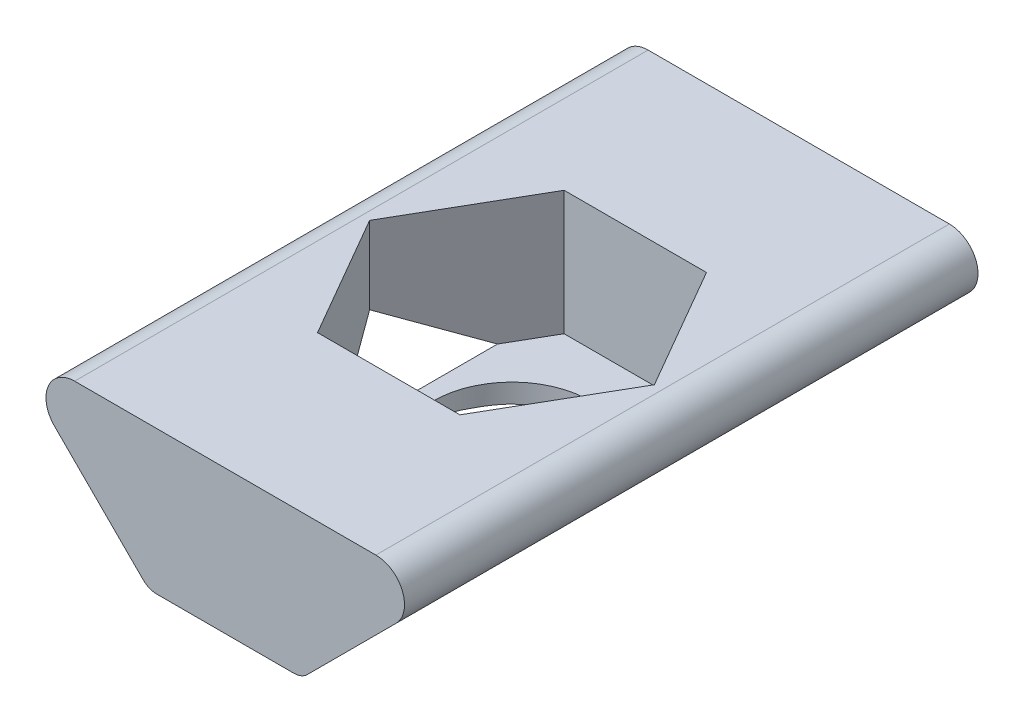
ISO-10303-21;
HEADER;
FILE_DESCRIPTION(('STEP AP214'),'2;1');
FILE_NAME('part.step','',(''),(''),'','','');
FILE_SCHEMA(('AUTOMOTIVE_DESIGN { 1 0 10303 214 1 1 1 1 }'));
ENDSEC;
DATA;
#1=APPLICATION_CONTEXT('core data for automotive mechanical design processes');
#2=APPLICATION_PROTOCOL_DEFINITION('international standard','automotive_design',2000,#1);
#3=PRODUCT_CONTEXT('',#1,'mechanical');
#4=PRODUCT('Part','Part','',(#3));
#5=PRODUCT_RELATED_PRODUCT_CATEGORY('part','',(#4));
#6=PRODUCT_DEFINITION_FORMATION('','',#4);
#7=PRODUCT_DEFINITION_CONTEXT('part definition',#1,'design');
#8=PRODUCT_DEFINITION('design','',#6,#7);
#9=PRODUCT_DEFINITION_SHAPE('','',#8);
#10=(LENGTH_UNIT() NAMED_UNIT(*) SI_UNIT(.MILLI.,.METRE.));
#11=(NAMED_UNIT(*) PLANE_ANGLE_UNIT() SI_UNIT($,.RADIAN.));
#12=(NAMED_UNIT(*) SI_UNIT($,.STERADIAN.) SOLID_ANGLE_UNIT());
#13=UNCERTAINTY_MEASURE_WITH_UNIT(LENGTH_MEASURE(1.E-05),#10,'distance_accuracy_value','');
#14=(GEOMETRIC_REPRESENTATION_CONTEXT(3) GLOBAL_UNCERTAINTY_ASSIGNED_CONTEXT((#13)) GLOBAL_UNIT_ASSIGNED_CONTEXT((#10,
#11,#12)) REPRESENTATION_CONTEXT('',''));
#15=CARTESIAN_POINT('',(0.,0.,0.));
#16=DIRECTION('',(0.,0.,1.));
#17=DIRECTION('',(1.,0.,0.));
#18=AXIS2_PLACEMENT_3D('',#15,#16,#17);
#19=CARTESIAN_POINT('',(-4.,-3.75,15.));
#20=DIRECTION('',(0.,1.,0.));
#21=DIRECTION('',(0.,0.,1.));
#22=AXIS2_PLACEMENT_3D('',#19,#20,#21);
#23=PLANE('',#22);
#24=DIRECTION('',(0.,0.,-1.));
#25=VECTOR('',#24,1.);
#26=CARTESIAN_POINT('',(3.58578643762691,-3.75,15.));
#27=LINE('',#26,#25);
#28=CARTESIAN_POINT('',(3.58578643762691,-3.75,-15.));
#29=VERTEX_POINT('',#28);
#30=CARTESIAN_POINT('',(3.58578643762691,-3.75,-1.98799789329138));
#31=VERTEX_POINT('',#30);
#32=EDGE_CURVE('E194',#29,#31,#27,.F.);
#33=ORIENTED_EDGE('',*,*,#32,.T.);
#34=CARTESIAN_POINT('',(0.,-3.75,0.));
#35=DIRECTION('',(0.,1.,0.));
#36=DIRECTION('',(0.,0.,1.));
#37=AXIS2_PLACEMENT_3D('',#34,#35,#36);
#38=CIRCLE('',#37,4.1);
#39=CARTESIAN_POINT('',(-3.58578643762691,-3.75,-1.98799789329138));
#40=VERTEX_POINT('',#39);
#41=EDGE_CURVE('E169',#31,#40,#38,.T.);
#42=ORIENTED_EDGE('',*,*,#41,.T.);
#43=DIRECTION('',(0.,0.,-1.));
#44=VECTOR('',#43,1.);
#45=CARTESIAN_POINT('',(-3.58578643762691,-3.75,15.));
#46=LINE('',#45,#44);
#47=CARTESIAN_POINT('',(-3.58578643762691,-3.75,-15.));
#48=VERTEX_POINT('',#47);
#49=EDGE_CURVE('E193',#40,#48,#46,.T.);
#50=ORIENTED_EDGE('',*,*,#49,.T.);
#51=DIRECTION('',(1.,0.,0.));
#52=VECTOR('',#51,1.);
#53=CARTESIAN_POINT('',(-4.,-3.75,-15.));
#54=LINE('',#53,#52);
#55=EDGE_CURVE('E247',#48,#29,#54,.T.);
#56=ORIENTED_EDGE('',*,*,#55,.T.);
#57=EDGE_LOOP('',(#33,#42,#50,#56));
#58=FACE_BOUND('',#57,.T.);
#59=ADVANCED_FACE('F37',(#58),#23,.F.);
#60=CARTESIAN_POINT('',(11.5,3.75000000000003,15.));
#61=DIRECTION('',(-0.707106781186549,0.707106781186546,0.));
#62=DIRECTION('',(-0.707106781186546,-0.707106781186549,0.));
#63=AXIS2_PLACEMENT_3D('',#60,#61,#62);
#64=PLANE('',#63);
#65=DIRECTION('',(0.,0.,-1.));
#66=VECTOR('',#65,1.);
#67=CARTESIAN_POINT('',(5.00000000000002,-2.74999999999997,15.));
#68=LINE('',#67,#66);
#69=CARTESIAN_POINT('',(5.00000000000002,-2.74999999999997,4.23974596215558));
#70=VERTEX_POINT('',#69);
#71=CARTESIAN_POINT('',(5.00000000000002,-2.74999999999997,-4.23974596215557));
#72=VERTEX_POINT('',#71);
#73=EDGE_CURVE('E236',#70,#72,#68,.T.);
#74=ORIENTED_EDGE('',*,*,#73,.F.);
#75=DIRECTION('',(0.447213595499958,0.447213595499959,-0.774596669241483));
#76=VECTOR('',#75,1.);
#77=CARTESIAN_POINT('',(3.87253866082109,-3.87746133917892,6.19256628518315));
#78=LINE('',#77,#76);
#79=CARTESIAN_POINT('',(7.44781847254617,-0.302181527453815,0.));
#80=VERTEX_POINT('',#79);
#81=EDGE_CURVE('E241',#70,#80,#78,.T.);
#82=ORIENTED_EDGE('',*,*,#81,.T.);
#83=DIRECTION('',(-0.447213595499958,-0.447213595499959,-0.774596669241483));
#84=VECTOR('',#83,1.);
#85=CARTESIAN_POINT('',(14.2648435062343,6.51484350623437,11.8074337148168));
#86=LINE('',#85,#84);
#87=EDGE_CURVE('E238',#80,#72,#86,.T.);
#88=ORIENTED_EDGE('',*,*,#87,.T.);
#89=EDGE_LOOP('',(#74,#82,#88));
#90=FACE_BOUND('',#89,.T.);
#91=DIRECTION('',(0.707106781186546,0.707106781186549,0.));
#92=VECTOR('',#91,1.);
#93=CARTESIAN_POINT('',(11.5,3.75000000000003,15.));
#94=LINE('',#93,#92);
#95=CARTESIAN_POINT('',(4.29289321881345,-3.45710678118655,15.));
#96=VERTEX_POINT('',#95);
#97=CARTESIAN_POINT('',(8.93933982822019,1.18933982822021,15.));
#98=VERTEX_POINT('',#97);
#99=EDGE_CURVE('E244',#96,#98,#94,.T.);
#100=ORIENTED_EDGE('',*,*,#99,.F.);
#101=DIRECTION('',(0.,0.,-1.));
#102=VECTOR('',#101,1.);
#103=CARTESIAN_POINT('',(4.29289321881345,-3.45710678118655,15.));
#104=LINE('',#103,#102);
#105=CARTESIAN_POINT('',(4.29289321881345,-3.45710678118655,-15.));
#106=VERTEX_POINT('',#105);
#107=EDGE_CURVE('E283',#96,#106,#104,.T.);
#108=ORIENTED_EDGE('',*,*,#107,.T.);
#109=DIRECTION('',(0.707106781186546,0.707106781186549,0.));
#110=VECTOR('',#109,1.);
#111=CARTESIAN_POINT('',(11.5,3.75000000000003,-15.));
#112=LINE('',#111,#110);
#113=CARTESIAN_POINT('',(8.93933982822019,1.18933982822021,-15.));
#114=VERTEX_POINT('',#113);
#115=EDGE_CURVE('E242',#106,#114,#112,.T.);
#116=ORIENTED_EDGE('',*,*,#115,.T.);
#117=DIRECTION('',(0.,0.,-1.));
#118=VECTOR('',#117,1.);
#119=CARTESIAN_POINT('',(8.93933982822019,1.18933982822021,15.));
#120=LINE('',#119,#118);
#121=EDGE_CURVE('E273',#114,#98,#120,.F.);
#122=ORIENTED_EDGE('',*,*,#121,.T.);
#123=EDGE_LOOP('',(#100,#108,#116,#122));
#124=FACE_BOUND('',#123,.T.);
#125=ADVANCED_FACE('F320',(#90,#124),#64,.F.);
#126=CARTESIAN_POINT('',(11.5,3.75000000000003,15.));
#127=DIRECTION('',(0.,-1.,0.));
#128=DIRECTION('',(0.,0.,-1.));
#129=AXIS2_PLACEMENT_3D('',#126,#127,#128);
#130=PLANE('',#129);
#131=DIRECTION('',(-0.5,0.,-0.866025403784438));
#132=VECTOR('',#131,1.);
#133=CARTESIAN_POINT('',(7.44781847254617,3.75000000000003,0.));
#134=LINE('',#133,#132);
#135=CARTESIAN_POINT('',(7.44781847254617,3.75000000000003,0.));
#136=VERTEX_POINT('',#135);
#137=CARTESIAN_POINT('',(3.72390923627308,3.75000000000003,-6.45));
#138=VERTEX_POINT('',#137);
#139=EDGE_CURVE('E398',#136,#138,#134,.T.);
#140=ORIENTED_EDGE('',*,*,#139,.F.);
#141=DIRECTION('',(0.5,0.,-0.866025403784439));
#142=VECTOR('',#141,1.);
#143=CARTESIAN_POINT('',(3.72390923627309,3.75000000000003,6.45));
#144=LINE('',#143,#142);
#145=CARTESIAN_POINT('',(3.72390923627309,3.75000000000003,6.45));
#146=VERTEX_POINT('',#145);
#147=EDGE_CURVE('E172',#146,#136,#144,.T.);
#148=ORIENTED_EDGE('',*,*,#147,.F.);
#149=DIRECTION('',(1.,0.,0.));
#150=VECTOR('',#149,1.);
#151=CARTESIAN_POINT('',(-3.72390923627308,3.75000000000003,6.45));
#152=LINE('',#151,#150);
#153=CARTESIAN_POINT('',(-3.72390923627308,3.75000000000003,6.45));
#154=VERTEX_POINT('',#153);
#155=EDGE_CURVE('E389',#154,#146,#152,.T.);
#156=ORIENTED_EDGE('',*,*,#155,.F.);
#157=DIRECTION('',(0.5,0.,0.866025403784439));
#158=VECTOR('',#157,1.);
#159=CARTESIAN_POINT('',(-7.44781847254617,3.75000000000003,0.));
#160=LINE('',#159,#158);
#161=CARTESIAN_POINT('',(-7.44781847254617,3.75000000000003,0.));
#162=VERTEX_POINT('',#161);
#163=EDGE_CURVE('E401',#162,#154,#160,.T.);
#164=ORIENTED_EDGE('',*,*,#163,.F.);
#165=DIRECTION('',(-0.5,0.,0.866025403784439));
#166=VECTOR('',#165,1.);
#167=CARTESIAN_POINT('',(-3.72390923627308,3.75000000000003,-6.45));
#168=LINE('',#167,#166);
#169=CARTESIAN_POINT('',(-3.72390923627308,3.75000000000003,-6.45));
#170=VERTEX_POINT('',#169);
#171=EDGE_CURVE('E219',#170,#162,#168,.T.);
#172=ORIENTED_EDGE('',*,*,#171,.F.);
#173=DIRECTION('',(-1.,0.,0.));
#174=VECTOR('',#173,1.);
#175=CARTESIAN_POINT('',(3.72390923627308,3.75000000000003,-6.45));
#176=LINE('',#175,#174);
#177=EDGE_CURVE('E400',#138,#170,#176,.T.);
#178=ORIENTED_EDGE('',*,*,#177,.F.);
#179=EDGE_LOOP('',(#140,#148,#156,#164,#172,#178));
#180=FACE_BOUND('',#179,.T.);
#181=DIRECTION('',(-1.,0.,0.));
#182=VECTOR('',#181,1.);
#183=CARTESIAN_POINT('',(11.5,3.75000000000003,15.));
#184=LINE('',#183,#182);
#185=CARTESIAN_POINT('',(7.87867965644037,3.75000000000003,15.));
#186=VERTEX_POINT('',#185);
#187=CARTESIAN_POINT('',(-7.87867965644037,3.75000000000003,15.));
#188=VERTEX_POINT('',#187);
#189=EDGE_CURVE('E250',#186,#188,#184,.T.);
#190=ORIENTED_EDGE('',*,*,#189,.F.);
#191=DIRECTION('',(0.,0.,-1.));
#192=VECTOR('',#191,1.);
#193=CARTESIAN_POINT('',(7.87867965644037,3.75000000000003,15.));
#194=LINE('',#193,#192);
#195=CARTESIAN_POINT('',(7.87867965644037,3.75000000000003,-15.));
#196=VERTEX_POINT('',#195);
#197=EDGE_CURVE('E269',#186,#196,#194,.T.);
#198=ORIENTED_EDGE('',*,*,#197,.T.);
#199=DIRECTION('',(-1.,0.,0.));
#200=VECTOR('',#199,1.);
#201=CARTESIAN_POINT('',(11.5,3.75000000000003,-15.));
#202=LINE('',#201,#200);
#203=CARTESIAN_POINT('',(-7.87867965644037,3.75000000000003,-15.));
#204=VERTEX_POINT('',#203);
#205=EDGE_CURVE('E260',#196,#204,#202,.T.);
#206=ORIENTED_EDGE('',*,*,#205,.T.);
#207=DIRECTION('',(0.,0.,-1.));
#208=VECTOR('',#207,1.);
#209=CARTESIAN_POINT('',(-7.87867965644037,3.75000000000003,15.));
#210=LINE('',#209,#208);
#211=EDGE_CURVE('E259',#204,#188,#210,.F.);
#212=ORIENTED_EDGE('',*,*,#211,.T.);
#213=EDGE_LOOP('',(#190,#198,#206,#212));
#214=FACE_BOUND('',#213,.T.);
#215=ADVANCED_FACE('F321',(#180,#214),#130,.F.);
#216=CARTESIAN_POINT('',(-11.5,3.75000000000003,15.));
#217=DIRECTION('',(0.707106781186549,0.707106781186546,0.));
#218=DIRECTION('',(-0.707106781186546,0.707106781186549,0.));
#219=AXIS2_PLACEMENT_3D('',#216,#217,#218);
#220=PLANE('',#219);
#221=DIRECTION('',(-0.447213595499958,0.447213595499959,0.774596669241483));
#222=VECTOR('',#221,1.);
#223=CARTESIAN_POINT('',(-14.2648435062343,6.51484350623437,11.8074337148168));
#224=LINE('',#223,#222);
#225=CARTESIAN_POINT('',(-5.00000000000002,-2.74999999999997,-4.23974596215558));
#226=VERTEX_POINT('',#225);
#227=CARTESIAN_POINT('',(-7.44781847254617,-0.302181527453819,0.));
#228=VERTEX_POINT('',#227);
#229=EDGE_CURVE('E47',#226,#228,#224,.T.);
#230=ORIENTED_EDGE('',*,*,#229,.T.);
#231=DIRECTION('',(0.447213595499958,-0.447213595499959,0.774596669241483));
#232=VECTOR('',#231,1.);
#233=CARTESIAN_POINT('',(-3.87253866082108,-3.87746133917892,6.19256628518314));
#234=LINE('',#233,#232);
#235=CARTESIAN_POINT('',(-5.00000000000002,-2.74999999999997,4.23974596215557));
#236=VERTEX_POINT('',#235);
#237=EDGE_CURVE('E11',#228,#236,#234,.T.);
#238=ORIENTED_EDGE('',*,*,#237,.T.);
#239=DIRECTION('',(0.,0.,1.));
#240=VECTOR('',#239,1.);
#241=CARTESIAN_POINT('',(-5.00000000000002,-2.74999999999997,15.));
#242=LINE('',#241,#240);
#243=EDGE_CURVE('E204',#226,#236,#242,.T.);
#244=ORIENTED_EDGE('',*,*,#243,.F.);
#245=EDGE_LOOP('',(#230,#238,#244));
#246=FACE_BOUND('',#245,.T.);
#247=DIRECTION('',(0.707106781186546,-0.707106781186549,0.));
#248=VECTOR('',#247,1.);
#249=CARTESIAN_POINT('',(-11.5,3.75000000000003,-15.));
#250=LINE('',#249,#248);
#251=CARTESIAN_POINT('',(-8.93933982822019,1.18933982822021,-15.));
#252=VERTEX_POINT('',#251);
#253=CARTESIAN_POINT('',(-4.29289321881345,-3.45710678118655,-15.));
#254=VERTEX_POINT('',#253);
#255=EDGE_CURVE('E262',#252,#254,#250,.T.);
#256=ORIENTED_EDGE('',*,*,#255,.T.);
#257=DIRECTION('',(0.,0.,-1.));
#258=VECTOR('',#257,1.);
#259=CARTESIAN_POINT('',(-4.29289321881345,-3.45710678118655,15.));
#260=LINE('',#259,#258);
#261=CARTESIAN_POINT('',(-4.29289321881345,-3.45710678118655,15.));
#262=VERTEX_POINT('',#261);
#263=EDGE_CURVE('E198',#254,#262,#260,.F.);
#264=ORIENTED_EDGE('',*,*,#263,.T.);
#265=DIRECTION('',(0.707106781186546,-0.707106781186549,0.));
#266=VECTOR('',#265,1.);
#267=CARTESIAN_POINT('',(-11.5,3.75000000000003,15.));
#268=LINE('',#267,#266);
#269=CARTESIAN_POINT('',(-8.93933982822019,1.18933982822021,15.));
#270=VERTEX_POINT('',#269);
#271=EDGE_CURVE('E252',#270,#262,#268,.T.);
#272=ORIENTED_EDGE('',*,*,#271,.F.);
#273=DIRECTION('',(0.,0.,-1.));
#274=VECTOR('',#273,1.);
#275=CARTESIAN_POINT('',(-8.93933982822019,1.18933982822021,15.));
#276=LINE('',#275,#274);
#277=EDGE_CURVE('E285',#270,#252,#276,.T.);
#278=ORIENTED_EDGE('',*,*,#277,.T.);
#279=EDGE_LOOP('',(#256,#264,#272,#278));
#280=FACE_BOUND('',#279,.T.);
#281=ADVANCED_FACE('F210',(#246,#280),#220,.F.);
#282=CARTESIAN_POINT('',(-3.58578643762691,-3.75,15.));
#283=VERTEX_POINT('',#282);
#284=CARTESIAN_POINT('',(-3.58578643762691,-3.75,1.98799789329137));
#285=VERTEX_POINT('',#284);
#286=EDGE_CURVE('E183',#283,#285,#46,.T.);
#287=ORIENTED_EDGE('',*,*,#286,.T.);
#288=CARTESIAN_POINT('',(3.58578643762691,-3.75,1.98799789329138));
#289=VERTEX_POINT('',#288);
#290=EDGE_CURVE('E57',#285,#289,#38,.T.);
#291=ORIENTED_EDGE('',*,*,#290,.T.);
#292=CARTESIAN_POINT('',(3.58578643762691,-3.75,15.));
#293=VERTEX_POINT('',#292);
#294=EDGE_CURVE('E181',#289,#293,#27,.F.);
#295=ORIENTED_EDGE('',*,*,#294,.T.);
#296=DIRECTION('',(1.,0.,0.));
#297=VECTOR('',#296,1.);
#298=CARTESIAN_POINT('',(-4.,-3.75,15.));
#299=LINE('',#298,#297);
#300=EDGE_CURVE('E251',#283,#293,#299,.T.);
#301=ORIENTED_EDGE('',*,*,#300,.F.);
#302=EDGE_LOOP('',(#287,#291,#295,#301));
#303=FACE_BOUND('',#302,.T.);
#304=ADVANCED_FACE('F177',(#303),#23,.F.);
#305=CARTESIAN_POINT('',(0.,0.,15.));
#306=DIRECTION('',(0.,0.,1.));
#307=DIRECTION('',(1.,0.,0.));
#308=AXIS2_PLACEMENT_3D('',#305,#306,#307);
#309=PLANE('',#308);
#310=ORIENTED_EDGE('',*,*,#300,.T.);
#311=CARTESIAN_POINT('',(3.58578643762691,-2.75,15.));
#312=DIRECTION('',(0.,0.,1.));
#313=DIRECTION('',(1.,0.,0.));
#314=AXIS2_PLACEMENT_3D('',#311,#312,#313);
#315=CIRCLE('',#314,1.);
#316=EDGE_CURVE('E188',#293,#96,#315,.T.);
#317=ORIENTED_EDGE('',*,*,#316,.T.);
#318=ORIENTED_EDGE('',*,*,#99,.T.);
#319=CARTESIAN_POINT('',(7.87867965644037,2.25000000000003,15.));
#320=DIRECTION('',(0.,0.,1.));
#321=DIRECTION('',(1.,0.,0.));
#322=AXIS2_PLACEMENT_3D('',#319,#320,#321);
#323=CIRCLE('',#322,1.5);
#324=EDGE_CURVE('E277',#98,#186,#323,.T.);
#325=ORIENTED_EDGE('',*,*,#324,.T.);
#326=ORIENTED_EDGE('',*,*,#189,.T.);
#327=CARTESIAN_POINT('',(-7.87867965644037,2.25000000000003,15.));
#328=DIRECTION('',(0.,0.,1.));
#329=DIRECTION('',(1.,0.,0.));
#330=AXIS2_PLACEMENT_3D('',#327,#328,#329);
#331=CIRCLE('',#330,1.5);
#332=EDGE_CURVE('E280',#188,#270,#331,.T.);
#333=ORIENTED_EDGE('',*,*,#332,.T.);
#334=ORIENTED_EDGE('',*,*,#271,.T.);
#335=CARTESIAN_POINT('',(-3.58578643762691,-2.75,15.));
#336=DIRECTION('',(0.,0.,1.));
#337=DIRECTION('',(1.,0.,0.));
#338=AXIS2_PLACEMENT_3D('',#335,#336,#337);
#339=CIRCLE('',#338,1.);
#340=EDGE_CURVE('E195',#262,#283,#339,.T.);
#341=ORIENTED_EDGE('',*,*,#340,.T.);
#342=EDGE_LOOP('',(#310,#317,#318,#325,#326,#333,#334,#341));
#343=FACE_BOUND('',#342,.T.);
#344=ADVANCED_FACE('F303',(#343),#309,.T.);
#345=CARTESIAN_POINT('',(0.,0.,-15.));
#346=DIRECTION('',(0.,0.,1.));
#347=DIRECTION('',(1.,0.,0.));
#348=AXIS2_PLACEMENT_3D('',#345,#346,#347);
#349=PLANE('',#348);
#350=ORIENTED_EDGE('',*,*,#115,.F.);
#351=CARTESIAN_POINT('',(3.58578643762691,-2.75,-15.));
#352=DIRECTION('',(0.,0.,1.));
#353=DIRECTION('',(1.,0.,0.));
#354=AXIS2_PLACEMENT_3D('',#351,#352,#353);
#355=CIRCLE('',#354,1.);
#356=EDGE_CURVE('E290',#106,#29,#355,.F.);
#357=ORIENTED_EDGE('',*,*,#356,.T.);
#358=ORIENTED_EDGE('',*,*,#55,.F.);
#359=CARTESIAN_POINT('',(-3.58578643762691,-2.75,-15.));
#360=DIRECTION('',(0.,0.,1.));
#361=DIRECTION('',(1.,0.,0.));
#362=AXIS2_PLACEMENT_3D('',#359,#360,#361);
#363=CIRCLE('',#362,1.);
#364=EDGE_CURVE('E287',#48,#254,#363,.F.);
#365=ORIENTED_EDGE('',*,*,#364,.T.);
#366=ORIENTED_EDGE('',*,*,#255,.F.);
#367=CARTESIAN_POINT('',(-7.87867965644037,2.25000000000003,-15.));
#368=DIRECTION('',(0.,0.,1.));
#369=DIRECTION('',(1.,0.,0.));
#370=AXIS2_PLACEMENT_3D('',#367,#368,#369);
#371=CIRCLE('',#370,1.5);
#372=EDGE_CURVE('E266',#252,#204,#371,.F.);
#373=ORIENTED_EDGE('',*,*,#372,.T.);
#374=ORIENTED_EDGE('',*,*,#205,.F.);
#375=CARTESIAN_POINT('',(7.87867965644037,2.25000000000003,-15.));
#376=DIRECTION('',(0.,0.,1.));
#377=DIRECTION('',(1.,0.,0.));
#378=AXIS2_PLACEMENT_3D('',#375,#376,#377);
#379=CIRCLE('',#378,1.5);
#380=EDGE_CURVE('E275',#196,#114,#379,.F.);
#381=ORIENTED_EDGE('',*,*,#380,.T.);
#382=EDGE_LOOP('',(#350,#357,#358,#365,#366,#373,#374,#381));
#383=FACE_BOUND('',#382,.T.);
#384=ADVANCED_FACE('F297',(#383),#349,.F.);
#385=CARTESIAN_POINT('',(7.87867965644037,2.25000000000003,15.));
#386=DIRECTION('',(0.,0.,-1.));
#387=DIRECTION('',(-1.,0.,0.));
#388=AXIS2_PLACEMENT_3D('',#385,#386,#387);
#389=CYLINDRICAL_SURFACE('',#388,1.5);
#390=ORIENTED_EDGE('',*,*,#324,.F.);
#391=ORIENTED_EDGE('',*,*,#121,.F.);
#392=ORIENTED_EDGE('',*,*,#380,.F.);
#393=ORIENTED_EDGE('',*,*,#197,.F.);
#394=EDGE_LOOP('',(#390,#391,#392,#393));
#395=FACE_BOUND('',#394,.T.);
#396=ADVANCED_FACE('F305',(#395),#389,.T.);
#397=CARTESIAN_POINT('',(-7.87867965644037,2.25000000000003,15.));
#398=DIRECTION('',(0.,0.,-1.));
#399=DIRECTION('',(-1.,0.,0.));
#400=AXIS2_PLACEMENT_3D('',#397,#398,#399);
#401=CYLINDRICAL_SURFACE('',#400,1.5);
#402=ORIENTED_EDGE('',*,*,#332,.F.);
#403=ORIENTED_EDGE('',*,*,#211,.F.);
#404=ORIENTED_EDGE('',*,*,#372,.F.);
#405=ORIENTED_EDGE('',*,*,#277,.F.);
#406=EDGE_LOOP('',(#402,#403,#404,#405));
#407=FACE_BOUND('',#406,.T.);
#408=ADVANCED_FACE('F309',(#407),#401,.T.);
#409=CARTESIAN_POINT('',(3.58578643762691,-2.75,15.));
#410=DIRECTION('',(0.,0.,-1.));
#411=DIRECTION('',(-1.,0.,0.));
#412=AXIS2_PLACEMENT_3D('',#409,#410,#411);
#413=CYLINDRICAL_SURFACE('',#412,1.);
#414=CARTESIAN_POINT('',(3.58578643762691,-3.75,-1.98799789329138));
#415=CARTESIAN_POINT('',(3.61137143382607,-3.74999457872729,-1.94185143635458));
#416=CARTESIAN_POINT('',(3.63605541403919,-3.74901885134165,-1.89522610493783));
#417=CARTESIAN_POINT('',(3.68357561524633,-3.74549331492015,-1.80112366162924));
#418=CARTESIAN_POINT('',(3.70641259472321,-3.74294415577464,-1.75364690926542));
#419=CARTESIAN_POINT('',(3.77204901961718,-3.73349394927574,-1.61018495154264));
#420=CARTESIAN_POINT('',(3.81205129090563,-3.72478794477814,-1.51302839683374));
#421=CARTESIAN_POINT('',(3.88454766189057,-3.70506894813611,-1.3158167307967));
#422=CARTESIAN_POINT('',(3.91701410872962,-3.6940477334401,-1.21575241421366));
#423=CARTESIAN_POINT('',(3.97418116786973,-3.67200253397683,-1.01338129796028));
#424=CARTESIAN_POINT('',(3.99887861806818,-3.66097854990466,-0.91107360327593));
#425=CARTESIAN_POINT('',(4.04103066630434,-3.64068529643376,-0.701337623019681));
#426=CARTESIAN_POINT('',(4.05822726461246,-3.63148372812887,-0.593850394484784));
#427=CARTESIAN_POINT('',(4.08402676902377,-3.61716663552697,-0.377591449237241));
#428=CARTESIAN_POINT('',(4.09263216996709,-3.61204992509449,-0.268820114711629));
#429=CARTESIAN_POINT('',(4.10112545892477,-3.60700165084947,-0.0510798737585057));
#430=CARTESIAN_POINT('',(4.10103498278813,-3.60705721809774,0.0578878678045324));
#431=CARTESIAN_POINT('',(4.09219120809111,-3.61231025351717,0.275345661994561));
#432=CARTESIAN_POINT('',(4.08343733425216,-3.61750806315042,0.383835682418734));
#433=CARTESIAN_POINT('',(4.0581184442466,-3.63153007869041,0.593459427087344));
#434=CARTESIAN_POINT('',(4.04201751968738,-3.64013528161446,0.69466530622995));
#435=CARTESIAN_POINT('',(4.0023388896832,-3.65937823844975,0.895407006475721));
#436=CARTESIAN_POINT('',(3.97876027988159,-3.670016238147,0.994942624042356));
#437=CARTESIAN_POINT('',(3.92425264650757,-3.6914335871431,1.19192424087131));
#438=CARTESIAN_POINT('',(3.89332601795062,-3.70221288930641,1.2893709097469));
#439=CARTESIAN_POINT('',(3.82422065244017,-3.72182261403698,1.48181537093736));
#440=CARTESIAN_POINT('',(3.78604676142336,-3.73065433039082,1.57681475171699));
#441=CARTESIAN_POINT('',(3.72023568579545,-3.74122034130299,1.724337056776));
#442=CARTESIAN_POINT('',(3.69497513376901,-3.74437653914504,1.77782372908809));
#443=CARTESIAN_POINT('',(3.64211871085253,-3.74876239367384,1.88374067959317));
#444=CARTESIAN_POINT('',(3.61452170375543,-3.74999110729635,1.93617042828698));
#445=CARTESIAN_POINT('',(3.58578643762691,-3.75,1.98799789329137));
#446=B_SPLINE_CURVE_WITH_KNOTS('',3,(#414,#415,#416,#417,#418,#419,#420,#421,#422,#423,#424,
#425,#426,#427,#428,#429,#430,#431,#432,#433,#434,#435,#436,#437,#438,#439,#440,#441,#442,#443,
#444,#445),.UNSPECIFIED.,.F.,.F.,(4,2,2,2,2,2,2,2,2,2,2,2,2,2,2,4),(0.,0.158245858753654,
0.316426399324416,0.632310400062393,0.949335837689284,1.26649014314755,1.59382710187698,
1.92106897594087,2.24749667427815,2.57394604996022,2.8821433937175,3.1903780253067,
3.4985123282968,3.80644131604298,3.98407045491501,4.16178647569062),.UNSPECIFIED.);
#447=EDGE_CURVE('E164',#31,#289,#446,.T.);
#448=ORIENTED_EDGE('',*,*,#447,.F.);
#449=ORIENTED_EDGE('',*,*,#32,.F.);
#450=ORIENTED_EDGE('',*,*,#356,.F.);
#451=ORIENTED_EDGE('',*,*,#107,.F.);
#452=ORIENTED_EDGE('',*,*,#316,.F.);
#453=ORIENTED_EDGE('',*,*,#294,.F.);
#454=EDGE_LOOP('',(#448,#449,#450,#451,#452,#453));
#455=FACE_BOUND('',#454,.T.);
#456=ADVANCED_FACE('F189',(#455),#413,.T.);
#457=CARTESIAN_POINT('',(-3.58578643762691,-2.75,15.));
#458=DIRECTION('',(0.,0.,-1.));
#459=DIRECTION('',(-1.,0.,0.));
#460=AXIS2_PLACEMENT_3D('',#457,#458,#459);
#461=CYLINDRICAL_SURFACE('',#460,1.);
#462=CARTESIAN_POINT('',(-3.58578643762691,-3.75,1.98799789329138));
#463=CARTESIAN_POINT('',(-3.61137143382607,-3.74999457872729,1.94185143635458));
#464=CARTESIAN_POINT('',(-3.63605541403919,-3.74901885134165,1.89522610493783));
#465=CARTESIAN_POINT('',(-3.68357561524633,-3.74549331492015,1.80112366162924));
#466=CARTESIAN_POINT('',(-3.70641259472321,-3.74294415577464,1.75364690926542));
#467=CARTESIAN_POINT('',(-3.77204901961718,-3.73349394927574,1.61018495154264));
#468=CARTESIAN_POINT('',(-3.81205129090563,-3.72478794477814,1.51302839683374));
#469=CARTESIAN_POINT('',(-3.88454766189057,-3.70506894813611,1.3158167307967));
#470=CARTESIAN_POINT('',(-3.91701410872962,-3.6940477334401,1.21575241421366));
#471=CARTESIAN_POINT('',(-3.97418116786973,-3.67200253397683,1.01338129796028));
#472=CARTESIAN_POINT('',(-3.99887861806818,-3.66097854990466,0.91107360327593));
#473=CARTESIAN_POINT('',(-4.04103066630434,-3.64068529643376,0.701337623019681));
#474=CARTESIAN_POINT('',(-4.05822726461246,-3.63148372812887,0.593850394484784));
#475=CARTESIAN_POINT('',(-4.08402676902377,-3.61716663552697,0.377591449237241));
#476=CARTESIAN_POINT('',(-4.09263216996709,-3.61204992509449,0.268820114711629));
#477=CARTESIAN_POINT('',(-4.10112545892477,-3.60700165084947,0.0510798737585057));
#478=CARTESIAN_POINT('',(-4.10103498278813,-3.60705721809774,-0.0578878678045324));
#479=CARTESIAN_POINT('',(-4.09219120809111,-3.61231025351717,-0.275345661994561));
#480=CARTESIAN_POINT('',(-4.08343733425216,-3.61750806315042,-0.383835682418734));
#481=CARTESIAN_POINT('',(-4.0581184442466,-3.63153007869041,-0.593459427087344));
#482=CARTESIAN_POINT('',(-4.04201751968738,-3.64013528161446,-0.69466530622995));
#483=CARTESIAN_POINT('',(-4.0023388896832,-3.65937823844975,-0.895407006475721));
#484=CARTESIAN_POINT('',(-3.97876027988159,-3.670016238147,-0.994942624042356));
#485=CARTESIAN_POINT('',(-3.92425264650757,-3.6914335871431,-1.19192424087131));
#486=CARTESIAN_POINT('',(-3.89332601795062,-3.70221288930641,-1.2893709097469));
#487=CARTESIAN_POINT('',(-3.82422065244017,-3.72182261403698,-1.48181537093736));
#488=CARTESIAN_POINT('',(-3.78604676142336,-3.73065433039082,-1.57681475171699));
#489=CARTESIAN_POINT('',(-3.72023568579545,-3.74122034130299,-1.724337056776));
#490=CARTESIAN_POINT('',(-3.69497513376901,-3.74437653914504,-1.77782372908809));
#491=CARTESIAN_POINT('',(-3.64211871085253,-3.74876239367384,-1.88374067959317));
#492=CARTESIAN_POINT('',(-3.61452170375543,-3.74999110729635,-1.93617042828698));
#493=CARTESIAN_POINT('',(-3.58578643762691,-3.75,-1.98799789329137));
#494=B_SPLINE_CURVE_WITH_KNOTS('',3,(#462,#463,#464,#465,#466,#467,#468,#469,#470,#471,#472,
#473,#474,#475,#476,#477,#478,#479,#480,#481,#482,#483,#484,#485,#486,#487,#488,#489,#490,#491,
#492,#493),.UNSPECIFIED.,.F.,.F.,(4,2,2,2,2,2,2,2,2,2,2,2,2,2,2,4),(0.,0.158245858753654,
0.316426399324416,0.632310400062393,0.949335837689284,1.26649014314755,1.59382710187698,
1.92106897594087,2.24749667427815,2.57394604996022,2.8821433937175,3.1903780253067,
3.4985123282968,3.80644131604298,3.98407045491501,4.16178647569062),.UNSPECIFIED.);
#495=EDGE_CURVE('E174',#285,#40,#494,.T.);
#496=ORIENTED_EDGE('',*,*,#495,.F.);
#497=ORIENTED_EDGE('',*,*,#286,.F.);
#498=ORIENTED_EDGE('',*,*,#340,.F.);
#499=ORIENTED_EDGE('',*,*,#263,.F.);
#500=ORIENTED_EDGE('',*,*,#364,.F.);
#501=ORIENTED_EDGE('',*,*,#49,.F.);
#502=EDGE_LOOP('',(#496,#497,#498,#499,#500,#501));
#503=FACE_BOUND('',#502,.T.);
#504=ADVANCED_FACE('F45',(#503),#461,.T.);
#505=CARTESIAN_POINT('',(3.72390923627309,-2.74999999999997,6.45));
#506=DIRECTION('',(0.866025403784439,0.,0.5));
#507=DIRECTION('',(0.5,0.,-0.866025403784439));
#508=AXIS2_PLACEMENT_3D('',#505,#506,#507);
#509=PLANE('',#508);
#510=DIRECTION('',(0.5,0.,-0.866025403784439));
#511=VECTOR('',#510,1.);
#512=CARTESIAN_POINT('',(3.72390923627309,-2.74999999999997,6.45));
#513=LINE('',#512,#511);
#514=CARTESIAN_POINT('',(3.72390923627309,-2.74999999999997,6.45));
#515=VERTEX_POINT('',#514);
#516=EDGE_CURVE('E63',#515,#70,#513,.T.);
#517=ORIENTED_EDGE('',*,*,#516,.F.);
#518=DIRECTION('',(0.,1.,0.));
#519=VECTOR('',#518,1.);
#520=CARTESIAN_POINT('',(3.72390923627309,-2.74999999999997,6.45));
#521=LINE('',#520,#519);
#522=EDGE_CURVE('E221',#515,#146,#521,.T.);
#523=ORIENTED_EDGE('',*,*,#522,.T.);
#524=ORIENTED_EDGE('',*,*,#147,.T.);
#525=DIRECTION('',(0.,1.,0.));
#526=VECTOR('',#525,1.);
#527=CARTESIAN_POINT('',(7.44781847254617,-2.74999999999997,0.));
#528=LINE('',#527,#526);
#529=EDGE_CURVE('E235',#80,#136,#528,.T.);
#530=ORIENTED_EDGE('',*,*,#529,.F.);
#531=ORIENTED_EDGE('',*,*,#81,.F.);
#532=EDGE_LOOP('',(#517,#523,#524,#530,#531));
#533=FACE_BOUND('',#532,.T.);
#534=ADVANCED_FACE('F376',(#533),#509,.F.);
#535=CARTESIAN_POINT('',(7.44781847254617,-2.74999999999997,0.));
#536=DIRECTION('',(0.866025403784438,0.,-0.5));
#537=DIRECTION('',(-0.5,0.,-0.866025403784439));
#538=AXIS2_PLACEMENT_3D('',#535,#536,#537);
#539=PLANE('',#538);
#540=ORIENTED_EDGE('',*,*,#529,.T.);
#541=ORIENTED_EDGE('',*,*,#139,.T.);
#542=DIRECTION('',(0.,1.,0.));
#543=VECTOR('',#542,1.);
#544=CARTESIAN_POINT('',(3.72390923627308,-2.74999999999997,-6.45));
#545=LINE('',#544,#543);
#546=CARTESIAN_POINT('',(3.72390923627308,-2.74999999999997,-6.45));
#547=VERTEX_POINT('',#546);
#548=EDGE_CURVE('E227',#547,#138,#545,.T.);
#549=ORIENTED_EDGE('',*,*,#548,.F.);
#550=DIRECTION('',(-0.5,0.,-0.866025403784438));
#551=VECTOR('',#550,1.);
#552=CARTESIAN_POINT('',(7.44781847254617,-2.74999999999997,0.));
#553=LINE('',#552,#551);
#554=EDGE_CURVE('E383',#72,#547,#553,.T.);
#555=ORIENTED_EDGE('',*,*,#554,.F.);
#556=ORIENTED_EDGE('',*,*,#87,.F.);
#557=EDGE_LOOP('',(#540,#541,#549,#555,#556));
#558=FACE_BOUND('',#557,.T.);
#559=ADVANCED_FACE('F367',(#558),#539,.F.);
#560=CARTESIAN_POINT('',(-7.44781847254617,-2.74999999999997,0.));
#561=DIRECTION('',(-0.866025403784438,0.,0.5));
#562=DIRECTION('',(0.5,0.,0.866025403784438));
#563=AXIS2_PLACEMENT_3D('',#560,#561,#562);
#564=PLANE('',#563);
#565=DIRECTION('',(0.,1.,0.));
#566=VECTOR('',#565,1.);
#567=CARTESIAN_POINT('',(-7.44781847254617,-2.74999999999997,0.));
#568=LINE('',#567,#566);
#569=EDGE_CURVE('E217',#228,#162,#568,.T.);
#570=ORIENTED_EDGE('',*,*,#569,.T.);
#571=ORIENTED_EDGE('',*,*,#163,.T.);
#572=DIRECTION('',(0.,1.,0.));
#573=VECTOR('',#572,1.);
#574=CARTESIAN_POINT('',(-3.72390923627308,-2.74999999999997,6.45));
#575=LINE('',#574,#573);
#576=CARTESIAN_POINT('',(-3.72390923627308,-2.74999999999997,6.45));
#577=VERTEX_POINT('',#576);
#578=EDGE_CURVE('E224',#577,#154,#575,.T.);
#579=ORIENTED_EDGE('',*,*,#578,.F.);
#580=DIRECTION('',(0.5,0.,0.866025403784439));
#581=VECTOR('',#580,1.);
#582=CARTESIAN_POINT('',(-7.44781847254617,-2.74999999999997,0.));
#583=LINE('',#582,#581);
#584=EDGE_CURVE('E388',#236,#577,#583,.T.);
#585=ORIENTED_EDGE('',*,*,#584,.F.);
#586=ORIENTED_EDGE('',*,*,#237,.F.);
#587=EDGE_LOOP('',(#570,#571,#579,#585,#586));
#588=FACE_BOUND('',#587,.T.);
#589=ADVANCED_FACE('F366',(#588),#564,.F.);
#590=CARTESIAN_POINT('',(-3.72390923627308,-2.74999999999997,-6.45));
#591=DIRECTION('',(-0.866025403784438,0.,-0.5));
#592=DIRECTION('',(-0.5,0.,0.866025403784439));
#593=AXIS2_PLACEMENT_3D('',#590,#591,#592);
#594=PLANE('',#593);
#595=DIRECTION('',(-0.5,0.,0.866025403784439));
#596=VECTOR('',#595,1.);
#597=CARTESIAN_POINT('',(-3.72390923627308,-2.74999999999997,-6.45));
#598=LINE('',#597,#596);
#599=CARTESIAN_POINT('',(-3.72390923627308,-2.74999999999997,-6.45));
#600=VERTEX_POINT('',#599);
#601=EDGE_CURVE('E215',#600,#226,#598,.T.);
#602=ORIENTED_EDGE('',*,*,#601,.F.);
#603=DIRECTION('',(0.,1.,0.));
#604=VECTOR('',#603,1.);
#605=CARTESIAN_POINT('',(-3.72390923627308,-2.74999999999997,-6.45));
#606=LINE('',#605,#604);
#607=EDGE_CURVE('E222',#600,#170,#606,.T.);
#608=ORIENTED_EDGE('',*,*,#607,.T.);
#609=ORIENTED_EDGE('',*,*,#171,.T.);
#610=ORIENTED_EDGE('',*,*,#569,.F.);
#611=ORIENTED_EDGE('',*,*,#229,.F.);
#612=EDGE_LOOP('',(#602,#608,#609,#610,#611));
#613=FACE_BOUND('',#612,.T.);
#614=ADVANCED_FACE('F211',(#613),#594,.F.);
#615=CARTESIAN_POINT('',(0.,-2.74999999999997,0.));
#616=DIRECTION('',(0.,1.,0.));
#617=DIRECTION('',(0.,0.,1.));
#618=AXIS2_PLACEMENT_3D('',#615,#616,#617);
#619=PLANE('',#618);
#620=CARTESIAN_POINT('',(0.,-2.74999999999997,0.));
#621=DIRECTION('',(0.,1.,0.));
#622=DIRECTION('',(0.,0.,1.));
#623=AXIS2_PLACEMENT_3D('',#620,#621,#622);
#624=CIRCLE('',#623,4.1);
#625=CARTESIAN_POINT('',(0.,-2.74999999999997,4.1));
#626=VERTEX_POINT('',#625);
#627=EDGE_CURVE('E184',#626,#626,#624,.T.);
#628=ORIENTED_EDGE('',*,*,#627,.F.);
#629=EDGE_LOOP('',(#628));
#630=FACE_BOUND('',#629,.T.);
#631=ORIENTED_EDGE('',*,*,#73,.T.);
#632=ORIENTED_EDGE('',*,*,#554,.T.);
#633=DIRECTION('',(-1.,0.,0.));
#634=VECTOR('',#633,1.);
#635=CARTESIAN_POINT('',(3.72390923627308,-2.74999999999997,-6.45));
#636=LINE('',#635,#634);
#637=EDGE_CURVE('E411',#547,#600,#636,.T.);
#638=ORIENTED_EDGE('',*,*,#637,.T.);
#639=ORIENTED_EDGE('',*,*,#601,.T.);
#640=ORIENTED_EDGE('',*,*,#243,.T.);
#641=ORIENTED_EDGE('',*,*,#584,.T.);
#642=DIRECTION('',(1.,0.,0.));
#643=VECTOR('',#642,1.);
#644=CARTESIAN_POINT('',(-3.72390923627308,-2.74999999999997,6.45));
#645=LINE('',#644,#643);
#646=EDGE_CURVE('E232',#577,#515,#645,.T.);
#647=ORIENTED_EDGE('',*,*,#646,.T.);
#648=ORIENTED_EDGE('',*,*,#516,.T.);
#649=EDGE_LOOP('',(#631,#632,#638,#639,#640,#641,#647,#648));
#650=FACE_BOUND('',#649,.T.);
#651=ADVANCED_FACE('F357',(#630,#650),#619,.T.);
#652=CARTESIAN_POINT('',(-3.72390923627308,-2.74999999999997,6.45));
#653=DIRECTION('',(0.,0.,1.));
#654=DIRECTION('',(1.,0.,0.));
#655=AXIS2_PLACEMENT_3D('',#652,#653,#654);
#656=PLANE('',#655);
#657=ORIENTED_EDGE('',*,*,#155,.T.);
#658=ORIENTED_EDGE('',*,*,#522,.F.);
#659=ORIENTED_EDGE('',*,*,#646,.F.);
#660=ORIENTED_EDGE('',*,*,#578,.T.);
#661=EDGE_LOOP('',(#657,#658,#659,#660));
#662=FACE_BOUND('',#661,.T.);
#663=ADVANCED_FACE('F363',(#662),#656,.F.);
#664=CARTESIAN_POINT('',(3.72390923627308,-2.74999999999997,-6.45));
#665=DIRECTION('',(0.,0.,-1.));
#666=DIRECTION('',(-1.,0.,0.));
#667=AXIS2_PLACEMENT_3D('',#664,#665,#666);
#668=PLANE('',#667);
#669=ORIENTED_EDGE('',*,*,#177,.T.);
#670=ORIENTED_EDGE('',*,*,#607,.F.);
#671=ORIENTED_EDGE('',*,*,#637,.F.);
#672=ORIENTED_EDGE('',*,*,#548,.T.);
#673=EDGE_LOOP('',(#669,#670,#671,#672));
#674=FACE_BOUND('',#673,.T.);
#675=ADVANCED_FACE('F358',(#674),#668,.F.);
#676=CARTESIAN_POINT('',(0.,-3.75,0.));
#677=DIRECTION('',(0.,1.,0.));
#678=DIRECTION('',(0.,0.,1.));
#679=AXIS2_PLACEMENT_3D('',#676,#677,#678);
#680=CYLINDRICAL_SURFACE('',#679,4.1);
#681=ORIENTED_EDGE('',*,*,#447,.T.);
#682=ORIENTED_EDGE('',*,*,#290,.F.);
#683=ORIENTED_EDGE('',*,*,#495,.T.);
#684=ORIENTED_EDGE('',*,*,#41,.F.);
#685=EDGE_LOOP('',(#681,#682,#683,#684));
#686=FACE_BOUND('',#685,.T.);
#687=ORIENTED_EDGE('',*,*,#627,.T.);
#688=EDGE_LOOP('',(#687));
#689=FACE_BOUND('',#688,.T.);
#690=ADVANCED_FACE('F168',(#686,#689),#680,.F.);
#691=CLOSED_SHELL('',(#59,#125,#215,#281,#304,#344,#384,#396,#408,#456,#504,#534,#559,#589,#614,
#651,#663,#675,#690));
#692=MANIFOLD_SOLID_BREP('B2',#691);
#693=ADVANCED_BREP_SHAPE_REPRESENTATION('',(#18,#692),#14);
#694=SHAPE_DEFINITION_REPRESENTATION(#9,#693);
ENDSEC;
END-ISO-10303-21;
